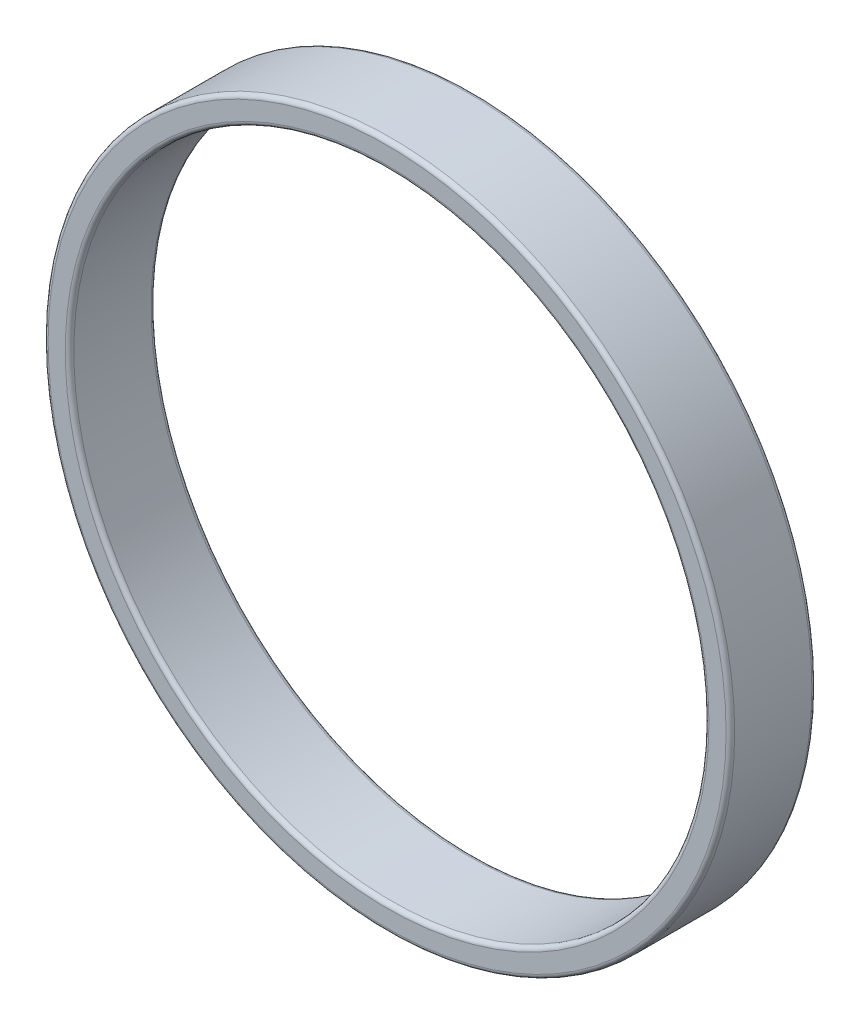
from build123d import *

# Parameters (mm, degrees)
SKETCH1_R           = 50.8
SKETCH1_R_2         = 46.99
BOSS_EXTRUDE1_DEPTH = 12.7
FILLET1_R           = 0.635


with BuildPart() as part:
    # Sketch1 → Boss-Extrude1 (new body)
    with BuildSketch(Plane.XY):
        Circle(SKETCH1_R)
        Circle(SKETCH1_R_2, mode=Mode.SUBTRACT)
    extrude(amount=BOSS_EXTRUDE1_DEPTH)

    # Fillet1
    fillet1_edges = [part.edges().sort_by_distance(p)[0] for p in [
        (-50.8, 0, 0),
        (-50.8, 0, 12.7),
        (-46.99, 0, 0),
        (-46.99, 0, 12.7),
    ]]
    fillet(fillet1_edges, radius=FILLET1_R)


solid = part.part
